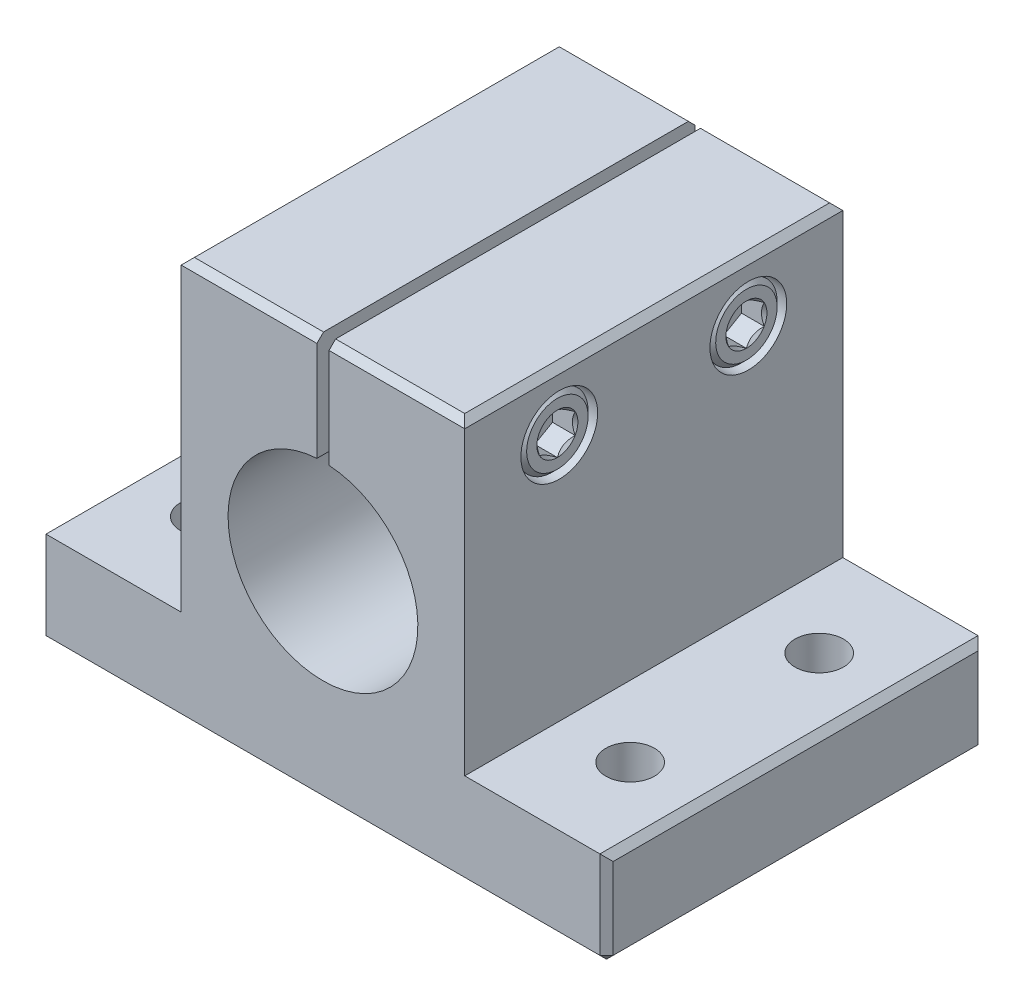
from build123d import *

# Parameters (mm, degrees)
BOSS_EXTRUDE1_DEPTH = 25.4
CHAMFER1_SIZE       = 0.889
SKETCH2_R           = 3.2639
CUT_EXTRUDE1_DEPTH  = 71.781852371
CUT_EXTRUDE4_DEPTH  = 3.048


with BuildPart() as part:
    # Sketch1 → Boss-Extrude1 (new, symmetric)
    with BuildSketch(Plane.XY):
        with BuildLine():
            Line((-38.1, 0), (38.1, 0))
            Line((38.1, 0), (38.1, 12.7))
            Line((38.1, 12.7), (19.05, 12.7))
            Line((19.05, 12.7), (19.05, 53.975))
            Line((19.05, 53.975), (0.8128, 53.975))
            Line((0.8128, 53.975), (0.8128, 39.712367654))
            ThreePointArc((0.8128, 39.712367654), (0, 14.2367), (-0.8128, 39.712367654))
            Line((-0.8128, 39.712367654), (-0.8128, 53.975))
            Line((-0.8128, 53.975), (-19.05, 53.975))
            Line((-19.05, 53.975), (-19.05, 12.7))
            Line((-19.05, 12.7), (-38.1, 12.7))
            Line((-38.1, 12.7), (-38.1, 0))
        make_face()
    extrude(amount=BOSS_EXTRUDE1_DEPTH, both=True)

    # Chamfer1
    chamfer1_edges = [part.edges().sort_by_distance(p)[0] for p in [
        (38.1, 6.35, 25.4),
        (-9.9314, 53.975, -25.4),
        (9.9314, 53.975, -25.4),
        (38.1, 6.35, -25.4),
        (0, 0, -25.4),
        (-38.1, 6.35, -25.4),
        (9.9314, 53.975, 25.4),
        (-38.1, 12.7, 0),
        (-19.05, 53.975, 0),
        (19.05, 53.975, 0),
        (38.1, 12.7, 0),
        (38.1, 0, 0),
        (-38.1, 0, 0),
        (-9.9314, 53.975, 25.4),
        (-38.1, 6.35, 25.4),
        (0, 0, 25.4),
    ]]
    chamfer(chamfer1_edges, length=CHAMFER1_SIZE)

    # Sketch2 → Cut-Extrude1 (cut, through all)
    with BuildSketch(Plane(origin=(0, 0, 0), x_dir=(1, 0, 0), z_dir=(0, 1, 0))):
        with Locations(Location((-28.575, -12.7, 0), (0, 0, 90))):
            Circle(SKETCH2_R)
        with Locations(Location((28.575, -12.7, 0), (0, 0, 90))):
            Circle(SKETCH2_R)
        with Locations(Location((-28.575, 12.7, 0), (0, 0, 90))):
            Circle(SKETCH2_R)
        with Locations(Location((28.575, 12.7, 0), (0, 0, 90))):
            Circle(SKETCH2_R)
    extrude(amount=CUT_EXTRUDE1_DEPTH, mode=Mode.SUBTRACT)

    # Sketch3 → Cut-Revolve1 (revolve, cut)
    with BuildSketch(Plane.XY.offset(12.7)):
        Polygon((-19.05, 46.0248), (-19.05, 49.1998), (-1.27, 49.1998), (-1.27, 49.2887), (12.446, 49.2887), (12.446, 51.181), (19.05, 51.181), (19.05, 46.0248), align=None)
    cut_revolve1 = revolve(axis=Axis((19.05, 46.0248, 12.7), (-1, 0, 0)), mode=Mode.SUBTRACT)

    # Mirror1: Cut-Revolve1 across plane
    add(cut_revolve1.mirror(Plane.XY), mode=Mode.SUBTRACT)


with BuildPart() as body_2:
    # Sketch4 → Revolve1 (revolve)
    with BuildSketch(Plane.XY.offset(12.7)):
        Polygon((-12.954, 46.0248), (-12.954, 49.1998), (12.446, 49.1998), (12.446, 50.6603), (12.573, 50.7873), (18.161, 50.7873), (18.796, 50.1523), (18.796, 46.0248), align=None)
    revolve(axis=Axis((18.796, 46.0248, 12.7), (-1, 0, 0)))

    # Sketch5 → Cut-Extrude4 (cut)
    with BuildSketch(Plane(origin=(18.796, 0, 0), x_dir=(0, 0, -1), z_dir=(1, 0, 0))):
        Polygon((-12.7, 48.781763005), (-15.0876, 47.403281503), (-15.0876, 44.646318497), (-12.7, 43.267836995), (-10.3124, 44.646318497), (-10.3124, 47.403281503), align=None)
    extrude(amount=-CUT_EXTRUDE4_DEPTH, mode=Mode.SUBTRACT)

    # Cut-Extrude5 cone 1 section (on through the dimple's axis) → Cut-Extrude5 (revolve, cut)
    with BuildSketch(Plane(origin=(18.796, 46.0248, 12.7), x_dir=(0, 0, -1), z_dir=(0, 1, 0))):
        Polygon((0, 0), (2.756963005, 0), (0, 2.756963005), align=None)
    revolve(axis=Axis((18.796, 46.0248, 12.7), (-1, 0, 0)), mode=Mode.SUBTRACT)


with BuildPart() as body_3:
    # Mirror2: mirrored copy
    add(body_2.part.mirror(Plane.XY))


solid = Compound([part.part, body_2.part, body_3.part])
